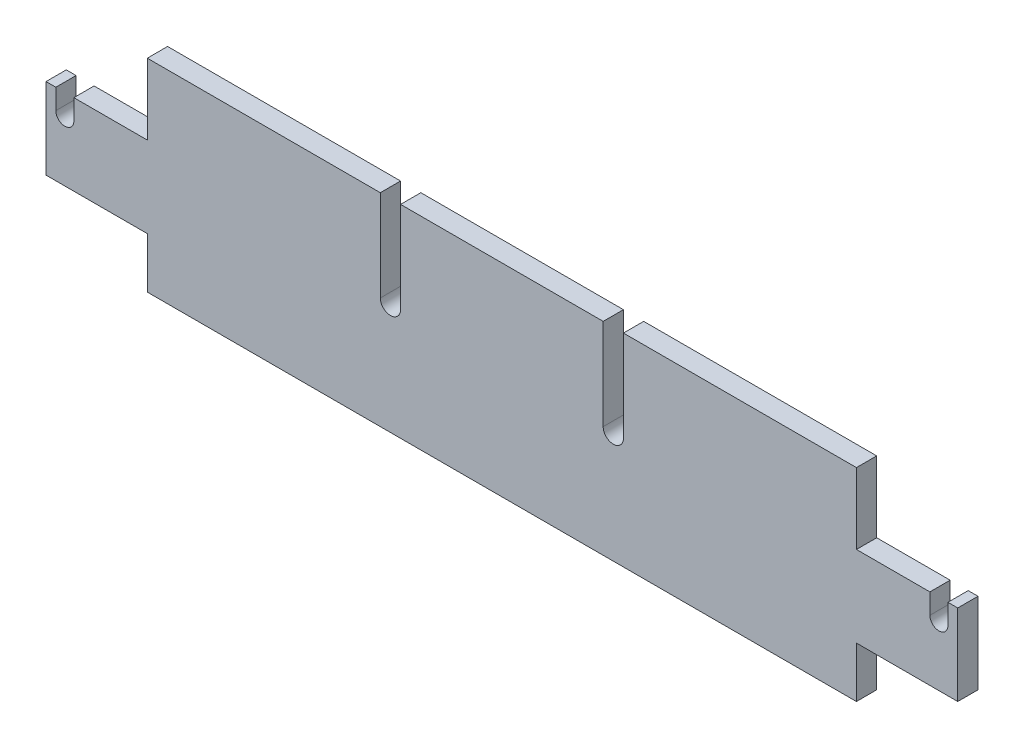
from build123d import *

# Parameters (mm, degrees)
RESSALTO_EXTRUS_O1_DEPTH = 2


with BuildPart() as part:
    # Esbo_o1 → Ressalto-extrus_o1 (new body)
    with BuildSketch(Plane.XY):
        with BuildLine():
            Line((-35, 0), (0, 0))
            Line((0, 0), (35, 0))
            Line((35, 0), (35, 5))
            Line((35, 5), (45, 5))
            Line((45, 5), (45, 13))
            Line((45, 13), (44.031459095, 13))
            Line((44.031459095, 13), (44.031459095, 11))
            ThreePointArc((44.031459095, 11), (43.141182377, 10.109723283), (42.25090566, 11))
            Line((42.25090566, 11), (42.25090566, 13))
            Line((42.25090566, 13), (35, 13))
            Line((35, 13), (35, 20))
            Line((35, 20), (12, 20))
            Line((12, 20), (12, 11))
            ThreePointArc((12, 11), (11, 10), (10, 11))
            Line((10, 11), (10, 20))
            Line((10, 20), (-10, 20))
            Line((-10, 20), (-10, 11))
            ThreePointArc((-10, 11), (-11, 10), (-12, 11))
            Line((-12, 11), (-12, 20))
            Line((-12, 20), (-35, 20))
            Line((-35, 20), (-35, 13))
            Line((-35, 13), (-42.25090566, 13))
            Line((-42.25090566, 13), (-42.25090566, 11))
            ThreePointArc((-42.25090566, 11), (-43.141182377, 10.109723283), (-44.031459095, 11))
            Line((-44.031459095, 11), (-44.031459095, 13))
            Line((-44.031459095, 13), (-45, 13))
            Line((-45, 13), (-45, 5))
            Line((-45, 5), (-35, 5))
            Line((-35, 5), (-35, 0))
        make_face()
    extrude(amount=RESSALTO_EXTRUS_O1_DEPTH)


solid = part.part
